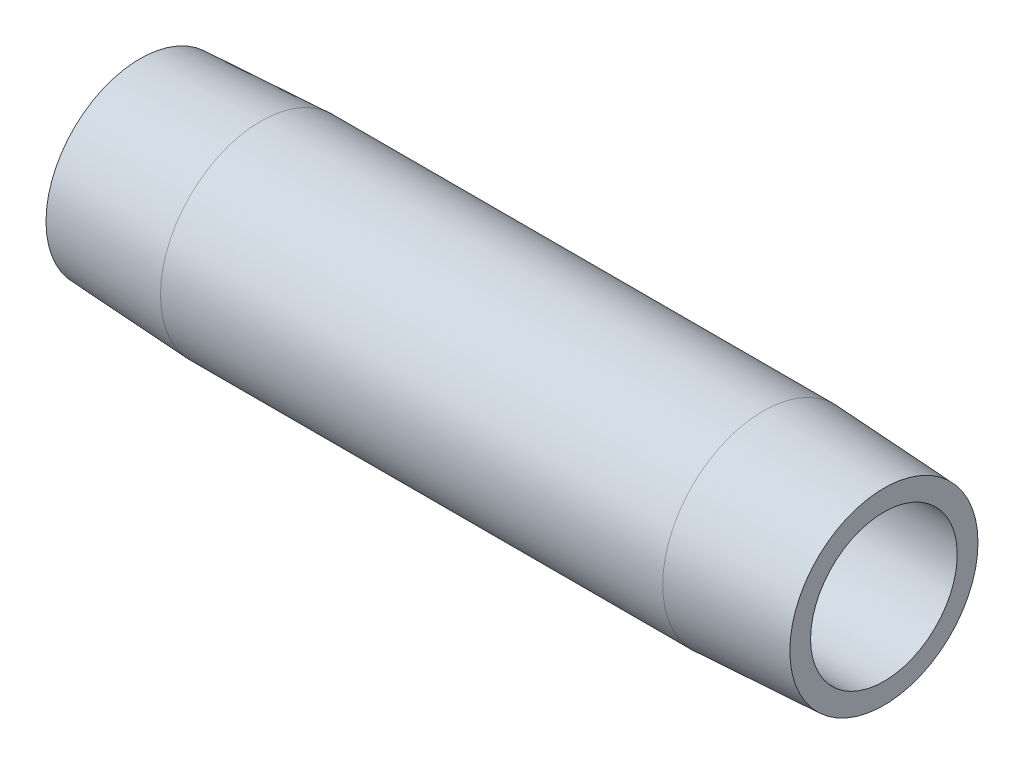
ISO-10303-21;
HEADER;
FILE_DESCRIPTION(('STEP AP214'),'2;1');
FILE_NAME('part.step','',(''),(''),'','','');
FILE_SCHEMA(('AUTOMOTIVE_DESIGN { 1 0 10303 214 1 1 1 1 }'));
ENDSEC;
DATA;
#1=APPLICATION_CONTEXT('core data for automotive mechanical design processes');
#2=APPLICATION_PROTOCOL_DEFINITION('international standard','automotive_design',2000,#1);
#3=PRODUCT_CONTEXT('',#1,'mechanical');
#4=PRODUCT('Part','Part','',(#3));
#5=PRODUCT_RELATED_PRODUCT_CATEGORY('part','',(#4));
#6=PRODUCT_DEFINITION_FORMATION('','',#4);
#7=PRODUCT_DEFINITION_CONTEXT('part definition',#1,'design');
#8=PRODUCT_DEFINITION('design','',#6,#7);
#9=PRODUCT_DEFINITION_SHAPE('','',#8);
#10=(LENGTH_UNIT() NAMED_UNIT(*) SI_UNIT(.MILLI.,.METRE.));
#11=(NAMED_UNIT(*) PLANE_ANGLE_UNIT() SI_UNIT($,.RADIAN.));
#12=(NAMED_UNIT(*) SI_UNIT($,.STERADIAN.) SOLID_ANGLE_UNIT());
#13=UNCERTAINTY_MEASURE_WITH_UNIT(LENGTH_MEASURE(1.E-05),#10,'distance_accuracy_value','');
#14=(GEOMETRIC_REPRESENTATION_CONTEXT(3) GLOBAL_UNCERTAINTY_ASSIGNED_CONTEXT((#13)) GLOBAL_UNIT_ASSIGNED_CONTEXT((#10,
#11,#12)) REPRESENTATION_CONTEXT('',''));
#15=CARTESIAN_POINT('',(0.,0.,0.));
#16=DIRECTION('',(0.,0.,1.));
#17=DIRECTION('',(1.,0.,0.));
#18=AXIS2_PLACEMENT_3D('',#15,#16,#17);
#19=CARTESIAN_POINT('',(63.5,6.26110000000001,0.));
#20=DIRECTION('',(-1.,0.,0.));
#21=DIRECTION('',(0.,0.,1.));
#22=AXIS2_PLACEMENT_3D('',#19,#20,#21);
#23=PLANE('',#22);
#24=CARTESIAN_POINT('',(63.5,0.,0.));
#25=DIRECTION('',(-1.,0.,0.));
#26=DIRECTION('',(0.,0.,1.));
#27=AXIS2_PLACEMENT_3D('',#24,#25,#26);
#28=CIRCLE('',#27,8.03205001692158);
#29=CARTESIAN_POINT('',(63.5,0.,8.03205001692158));
#30=VERTEX_POINT('',#29);
#31=EDGE_CURVE('E10',#30,#30,#28,.T.);
#32=ORIENTED_EDGE('',*,*,#31,.F.);
#33=EDGE_LOOP('',(#32));
#34=FACE_BOUND('',#33,.T.);
#35=CARTESIAN_POINT('',(63.5,0.,0.));
#36=DIRECTION('',(-1.,0.,0.));
#37=DIRECTION('',(0.,0.,1.));
#38=AXIS2_PLACEMENT_3D('',#35,#36,#37);
#39=CIRCLE('',#38,6.26110000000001);
#40=CARTESIAN_POINT('',(63.5,0.,6.26110000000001));
#41=VERTEX_POINT('',#40);
#42=EDGE_CURVE('E52',#41,#41,#39,.T.);
#43=ORIENTED_EDGE('',*,*,#42,.T.);
#44=EDGE_LOOP('',(#43));
#45=FACE_BOUND('',#44,.T.);
#46=ADVANCED_FACE('F30',(#34,#45),#23,.F.);
#47=CARTESIAN_POINT('',(63.5,0.,0.));
#48=DIRECTION('',(-1.,0.,0.));
#49=DIRECTION('',(0.,0.,1.));
#50=AXIS2_PLACEMENT_3D('',#47,#48,#49);
#51=CONICAL_SURFACE('',#50,8.03205001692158,0.0523598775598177);
#52=CARTESIAN_POINT('',(53.1876,0.,0.));
#53=DIRECTION('',(-1.,0.,0.));
#54=DIRECTION('',(0.,0.,1.));
#55=AXIS2_PLACEMENT_3D('',#52,#53,#54);
#56=CIRCLE('',#55,8.57249999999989);
#57=CARTESIAN_POINT('',(53.1876,0.,8.57249999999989));
#58=VERTEX_POINT('',#57);
#59=EDGE_CURVE('E36',#58,#58,#56,.T.);
#60=ORIENTED_EDGE('',*,*,#59,.F.);
#61=EDGE_LOOP('',(#60));
#62=FACE_BOUND('',#61,.T.);
#63=ORIENTED_EDGE('',*,*,#31,.T.);
#64=EDGE_LOOP('',(#63));
#65=FACE_BOUND('',#64,.T.);
#66=ADVANCED_FACE('F77',(#62,#65),#51,.T.);
#67=CARTESIAN_POINT('',(0.,0.,0.));
#68=DIRECTION('',(-1.,0.,0.));
#69=DIRECTION('',(0.,0.,1.));
#70=AXIS2_PLACEMENT_3D('',#67,#68,#69);
#71=CYLINDRICAL_SURFACE('',#70,8.57249999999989);
#72=CARTESIAN_POINT('',(10.3124,0.,0.));
#73=DIRECTION('',(-1.,0.,0.));
#74=DIRECTION('',(0.,0.,1.));
#75=AXIS2_PLACEMENT_3D('',#72,#73,#74);
#76=CIRCLE('',#75,8.57249999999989);
#77=CARTESIAN_POINT('',(10.3124,0.,8.57249999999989));
#78=VERTEX_POINT('',#77);
#79=EDGE_CURVE('E40',#78,#78,#76,.T.);
#80=ORIENTED_EDGE('',*,*,#79,.F.);
#81=EDGE_LOOP('',(#80));
#82=FACE_BOUND('',#81,.T.);
#83=ORIENTED_EDGE('',*,*,#59,.T.);
#84=EDGE_LOOP('',(#83));
#85=FACE_BOUND('',#84,.T.);
#86=ADVANCED_FACE('F72',(#82,#85),#71,.T.);
#87=CARTESIAN_POINT('',(10.3124,0.,0.));
#88=DIRECTION('',(1.,0.,0.));
#89=DIRECTION('',(0.,0.,-1.));
#90=AXIS2_PLACEMENT_3D('',#87,#88,#89);
#91=CONICAL_SURFACE('',#90,8.57249999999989,0.0523598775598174);
#92=CARTESIAN_POINT('',(0.,0.,0.));
#93=DIRECTION('',(-1.,0.,0.));
#94=DIRECTION('',(0.,0.,1.));
#95=AXIS2_PLACEMENT_3D('',#92,#93,#94);
#96=CIRCLE('',#95,8.03205001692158);
#97=CARTESIAN_POINT('',(0.,0.,8.03205001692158));
#98=VERTEX_POINT('',#97);
#99=EDGE_CURVE('E44',#98,#98,#96,.T.);
#100=ORIENTED_EDGE('',*,*,#99,.F.);
#101=EDGE_LOOP('',(#100));
#102=FACE_BOUND('',#101,.T.);
#103=ORIENTED_EDGE('',*,*,#79,.T.);
#104=EDGE_LOOP('',(#103));
#105=FACE_BOUND('',#104,.T.);
#106=ADVANCED_FACE('F66',(#102,#105),#91,.T.);
#107=CARTESIAN_POINT('',(0.,6.26110000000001,0.));
#108=DIRECTION('',(1.,0.,0.));
#109=DIRECTION('',(0.,0.,-1.));
#110=AXIS2_PLACEMENT_3D('',#107,#108,#109);
#111=PLANE('',#110);
#112=CARTESIAN_POINT('',(0.,0.,0.));
#113=DIRECTION('',(-1.,0.,0.));
#114=DIRECTION('',(0.,0.,1.));
#115=AXIS2_PLACEMENT_3D('',#112,#113,#114);
#116=CIRCLE('',#115,6.26110000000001);
#117=CARTESIAN_POINT('',(0.,0.,6.26110000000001));
#118=VERTEX_POINT('',#117);
#119=EDGE_CURVE('E49',#118,#118,#116,.T.);
#120=ORIENTED_EDGE('',*,*,#119,.F.);
#121=EDGE_LOOP('',(#120));
#122=FACE_BOUND('',#121,.T.);
#123=ORIENTED_EDGE('',*,*,#99,.T.);
#124=EDGE_LOOP('',(#123));
#125=FACE_BOUND('',#124,.T.);
#126=ADVANCED_FACE('F60',(#122,#125),#111,.F.);
#127=CARTESIAN_POINT('',(0.,0.,0.));
#128=DIRECTION('',(-1.,0.,0.));
#129=DIRECTION('',(0.,0.,1.));
#130=AXIS2_PLACEMENT_3D('',#127,#128,#129);
#131=CYLINDRICAL_SURFACE('',#130,6.26110000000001);
#132=ORIENTED_EDGE('',*,*,#42,.F.);
#133=EDGE_LOOP('',(#132));
#134=FACE_BOUND('',#133,.T.);
#135=ORIENTED_EDGE('',*,*,#119,.T.);
#136=EDGE_LOOP('',(#135));
#137=FACE_BOUND('',#136,.T.);
#138=ADVANCED_FACE('F57',(#134,#137),#131,.F.);
#139=CLOSED_SHELL('',(#46,#66,#86,#106,#126,#138));
#140=MANIFOLD_SOLID_BREP('B2',#139);
#141=ADVANCED_BREP_SHAPE_REPRESENTATION('',(#18,#140),#14);
#142=SHAPE_DEFINITION_REPRESENTATION(#9,#141);
ENDSEC;
END-ISO-10303-21;
